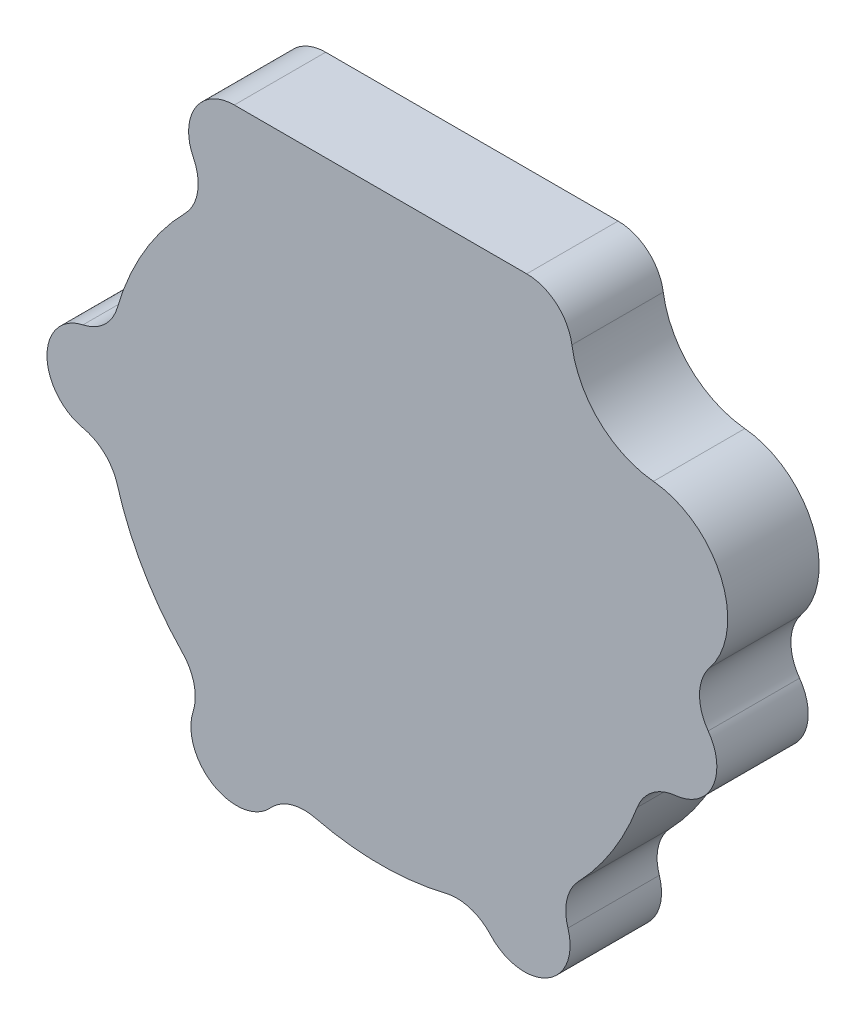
ISO-10303-21;
HEADER;
FILE_DESCRIPTION(('STEP AP214'),'2;1');
FILE_NAME('part.step','',(''),(''),'','','');
FILE_SCHEMA(('AUTOMOTIVE_DESIGN { 1 0 10303 214 1 1 1 1 }'));
ENDSEC;
DATA;
#1=APPLICATION_CONTEXT('core data for automotive mechanical design processes');
#2=APPLICATION_PROTOCOL_DEFINITION('international standard','automotive_design',2000,#1);
#3=PRODUCT_CONTEXT('',#1,'mechanical');
#4=PRODUCT('Part','Part','',(#3));
#5=PRODUCT_RELATED_PRODUCT_CATEGORY('part','',(#4));
#6=PRODUCT_DEFINITION_FORMATION('','',#4);
#7=PRODUCT_DEFINITION_CONTEXT('part definition',#1,'design');
#8=PRODUCT_DEFINITION('design','',#6,#7);
#9=PRODUCT_DEFINITION_SHAPE('','',#8);
#10=(LENGTH_UNIT() NAMED_UNIT(*) SI_UNIT(.MILLI.,.METRE.));
#11=(NAMED_UNIT(*) PLANE_ANGLE_UNIT() SI_UNIT($,.RADIAN.));
#12=(NAMED_UNIT(*) SI_UNIT($,.STERADIAN.) SOLID_ANGLE_UNIT());
#13=UNCERTAINTY_MEASURE_WITH_UNIT(LENGTH_MEASURE(1.E-05),#10,'distance_accuracy_value','');
#14=(GEOMETRIC_REPRESENTATION_CONTEXT(3) GLOBAL_UNCERTAINTY_ASSIGNED_CONTEXT((#13)) GLOBAL_UNIT_ASSIGNED_CONTEXT((#10,
#11,#12)) REPRESENTATION_CONTEXT('',''));
#15=CARTESIAN_POINT('',(0.,0.,0.));
#16=DIRECTION('',(0.,0.,1.));
#17=DIRECTION('',(1.,0.,0.));
#18=AXIS2_PLACEMENT_3D('',#15,#16,#17);
#19=CARTESIAN_POINT('',(-28.4340748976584,-24.2245230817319,10.));
#20=DIRECTION('',(0.,0.,-1.));
#21=DIRECTION('',(-1.,0.,0.));
#22=AXIS2_PLACEMENT_3D('',#19,#20,#21);
#23=CYLINDRICAL_SURFACE('',#22,5.);
#24=CARTESIAN_POINT('',(-28.4340748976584,-24.2245230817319,0.));
#25=DIRECTION('',(0.,0.,-1.));
#26=DIRECTION('',(1.,0.,0.));
#27=AXIS2_PLACEMENT_3D('',#24,#25,#26);
#28=CIRCLE('',#27,5.);
#29=CARTESIAN_POINT('',(-23.6330544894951,-25.6210197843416,0.));
#30=VERTEX_POINT('',#29);
#31=CARTESIAN_POINT('',(-27.380503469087,-29.112261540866,0.));
#32=VERTEX_POINT('',#31);
#33=EDGE_CURVE('E213',#30,#32,#28,.T.);
#34=ORIENTED_EDGE('',*,*,#33,.T.);
#35=DIRECTION('',(0.,0.,-1.));
#36=VECTOR('',#35,1.);
#37=CARTESIAN_POINT('',(-27.380503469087,-29.112261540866,10.));
#38=LINE('',#37,#36);
#39=CARTESIAN_POINT('',(-27.380503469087,-29.112261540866,10.));
#40=VERTEX_POINT('',#39);
#41=EDGE_CURVE('E11',#40,#32,#38,.T.);
#42=ORIENTED_EDGE('',*,*,#41,.F.);
#43=CARTESIAN_POINT('',(-28.4340748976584,-24.2245230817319,10.));
#44=DIRECTION('',(0.,0.,-1.));
#45=DIRECTION('',(1.,0.,0.));
#46=AXIS2_PLACEMENT_3D('',#43,#44,#45);
#47=CIRCLE('',#46,5.);
#48=CARTESIAN_POINT('',(-23.6330544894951,-25.6210197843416,10.));
#49=VERTEX_POINT('',#48);
#50=EDGE_CURVE('E256',#49,#40,#47,.T.);
#51=ORIENTED_EDGE('',*,*,#50,.F.);
#52=DIRECTION('',(0.,0.,-1.));
#53=VECTOR('',#52,1.);
#54=CARTESIAN_POINT('',(-23.6330544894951,-25.6210197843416,10.));
#55=LINE('',#54,#53);
#56=EDGE_CURVE('E209',#49,#30,#55,.T.);
#57=ORIENTED_EDGE('',*,*,#56,.T.);
#58=EDGE_LOOP('',(#34,#42,#51,#57));
#59=FACE_BOUND('',#58,.T.);
#60=ADVANCED_FACE('F33',(#59),#23,.F.);
#61=CARTESIAN_POINT('',(-26.3269320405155,-34.,10.));
#62=DIRECTION('',(0.,0.,-1.));
#63=DIRECTION('',(-1.,0.,0.));
#64=AXIS2_PLACEMENT_3D('',#61,#62,#63);
#65=CYLINDRICAL_SURFACE('',#64,5.);
#66=CARTESIAN_POINT('',(-26.3269320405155,-34.,0.));
#67=DIRECTION('',(0.,0.,1.));
#68=DIRECTION('',(1.,0.,0.));
#69=AXIS2_PLACEMENT_3D('',#66,#67,#68);
#70=CIRCLE('',#69,5.);
#71=CARTESIAN_POINT('',(-27.380503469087,-38.887738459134,0.));
#72=VERTEX_POINT('',#71);
#73=EDGE_CURVE('E216',#32,#72,#70,.T.);
#74=ORIENTED_EDGE('',*,*,#73,.T.);
#75=DIRECTION('',(0.,0.,-1.));
#76=VECTOR('',#75,1.);
#77=CARTESIAN_POINT('',(-27.380503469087,-38.887738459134,10.));
#78=LINE('',#77,#76);
#79=CARTESIAN_POINT('',(-27.380503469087,-38.887738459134,10.));
#80=VERTEX_POINT('',#79);
#81=EDGE_CURVE('E41',#80,#72,#78,.T.);
#82=ORIENTED_EDGE('',*,*,#81,.F.);
#83=CARTESIAN_POINT('',(-26.3269320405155,-34.,10.));
#84=DIRECTION('',(0.,0.,1.));
#85=DIRECTION('',(1.,0.,0.));
#86=AXIS2_PLACEMENT_3D('',#83,#84,#85);
#87=CIRCLE('',#86,5.);
#88=EDGE_CURVE('E134',#40,#80,#87,.T.);
#89=ORIENTED_EDGE('',*,*,#88,.F.);
#90=ORIENTED_EDGE('',*,*,#41,.T.);
#91=EDGE_LOOP('',(#74,#82,#89,#90));
#92=FACE_BOUND('',#91,.T.);
#93=ADVANCED_FACE('F383',(#92),#65,.T.);
#94=CARTESIAN_POINT('',(-28.4340748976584,-43.7754769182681,10.));
#95=DIRECTION('',(0.,0.,-1.));
#96=DIRECTION('',(-1.,0.,0.));
#97=AXIS2_PLACEMENT_3D('',#94,#95,#96);
#98=CYLINDRICAL_SURFACE('',#97,5.);
#99=CARTESIAN_POINT('',(-28.4340748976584,-43.7754769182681,0.));
#100=DIRECTION('',(0.,0.,-1.));
#101=DIRECTION('',(-1.,0.,0.));
#102=AXIS2_PLACEMENT_3D('',#99,#100,#101);
#103=CIRCLE('',#102,5.);
#104=CARTESIAN_POINT('',(-23.6330544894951,-42.3789802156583,0.));
#105=VERTEX_POINT('',#104);
#106=EDGE_CURVE('E218',#72,#105,#103,.T.);
#107=ORIENTED_EDGE('',*,*,#106,.T.);
#108=DIRECTION('',(0.,0.,-1.));
#109=VECTOR('',#108,1.);
#110=CARTESIAN_POINT('',(-23.6330544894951,-42.3789802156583,10.));
#111=LINE('',#110,#109);
#112=CARTESIAN_POINT('',(-23.6330544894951,-42.3789802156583,10.));
#113=VERTEX_POINT('',#112);
#114=EDGE_CURVE('E305',#113,#105,#111,.T.);
#115=ORIENTED_EDGE('',*,*,#114,.F.);
#116=CARTESIAN_POINT('',(-28.4340748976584,-43.7754769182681,10.));
#117=DIRECTION('',(0.,0.,-1.));
#118=DIRECTION('',(-1.,0.,0.));
#119=AXIS2_PLACEMENT_3D('',#116,#117,#118);
#120=CIRCLE('',#119,5.);
#121=EDGE_CURVE('E313',#80,#113,#120,.T.);
#122=ORIENTED_EDGE('',*,*,#121,.F.);
#123=ORIENTED_EDGE('',*,*,#81,.T.);
#124=EDGE_LOOP('',(#107,#115,#122,#123));
#125=FACE_BOUND('',#124,.T.);
#126=ADVANCED_FACE('F311',(#125),#98,.F.);
#127=CARTESIAN_POINT('',(5.17306795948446,-34.,10.));
#128=DIRECTION('',(0.,0.,-1.));
#129=DIRECTION('',(-1.,0.,0.));
#130=AXIS2_PLACEMENT_3D('',#127,#128,#129);
#131=CYLINDRICAL_SURFACE('',#130,30.);
#132=CARTESIAN_POINT('',(5.17306795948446,-34.,0.));
#133=DIRECTION('',(0.,0.,1.));
#134=DIRECTION('',(1.,0.,0.));
#135=AXIS2_PLACEMENT_3D('',#132,#133,#134);
#136=CIRCLE('',#135,30.);
#137=CARTESIAN_POINT('',(-16.4864029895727,-54.7573437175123,0.));
#138=VERTEX_POINT('',#137);
#139=EDGE_CURVE('E220',#105,#138,#136,.T.);
#140=ORIENTED_EDGE('',*,*,#139,.T.);
#141=DIRECTION('',(0.,0.,-1.));
#142=VECTOR('',#141,1.);
#143=CARTESIAN_POINT('',(-16.4864029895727,-54.7573437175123,10.));
#144=LINE('',#143,#142);
#145=CARTESIAN_POINT('',(-16.4864029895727,-54.7573437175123,10.));
#146=VERTEX_POINT('',#145);
#147=EDGE_CURVE('E302',#146,#138,#144,.T.);
#148=ORIENTED_EDGE('',*,*,#147,.F.);
#149=CARTESIAN_POINT('',(5.17306795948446,-34.,10.));
#150=DIRECTION('',(0.,0.,1.));
#151=DIRECTION('',(1.,0.,0.));
#152=AXIS2_PLACEMENT_3D('',#149,#150,#151);
#153=CIRCLE('',#152,30.);
#154=EDGE_CURVE('E331',#113,#146,#153,.T.);
#155=ORIENTED_EDGE('',*,*,#154,.F.);
#156=ORIENTED_EDGE('',*,*,#114,.T.);
#157=EDGE_LOOP('',(#140,#148,#155,#156));
#158=FACE_BOUND('',#157,.T.);
#159=ADVANCED_FACE('F322',(#158),#131,.T.);
#160=CARTESIAN_POINT('',(-20.0963148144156,-58.2169010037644,10.));
#161=DIRECTION('',(0.,0.,-1.));
#162=DIRECTION('',(-1.,0.,0.));
#163=AXIS2_PLACEMENT_3D('',#160,#161,#162);
#164=CYLINDRICAL_SURFACE('',#163,5.);
#165=CARTESIAN_POINT('',(-20.0963148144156,-58.2169010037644,0.));
#166=DIRECTION('',(0.,0.,-1.));
#167=DIRECTION('',(1.,0.,0.));
#168=AXIS2_PLACEMENT_3D('',#165,#166,#167);
#169=CIRCLE('',#168,5.);
#170=CARTESIAN_POINT('',(-15.3366234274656,-59.7483506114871,0.));
#171=VERTEX_POINT('',#170);
#172=EDGE_CURVE('E222',#138,#171,#169,.T.);
#173=ORIENTED_EDGE('',*,*,#172,.T.);
#174=DIRECTION('',(0.,0.,-1.));
#175=VECTOR('',#174,1.);
#176=CARTESIAN_POINT('',(-15.3366234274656,-59.7483506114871,10.));
#177=LINE('',#176,#175);
#178=CARTESIAN_POINT('',(-15.3366234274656,-59.7483506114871,10.));
#179=VERTEX_POINT('',#178);
#180=EDGE_CURVE('E299',#179,#171,#177,.T.);
#181=ORIENTED_EDGE('',*,*,#180,.F.);
#182=CARTESIAN_POINT('',(-20.0963148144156,-58.2169010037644,10.));
#183=DIRECTION('',(0.,0.,-1.));
#184=DIRECTION('',(1.,0.,0.));
#185=AXIS2_PLACEMENT_3D('',#182,#183,#184);
#186=CIRCLE('',#185,5.);
#187=EDGE_CURVE('E328',#146,#179,#186,.T.);
#188=ORIENTED_EDGE('',*,*,#187,.F.);
#189=ORIENTED_EDGE('',*,*,#147,.T.);
#190=EDGE_LOOP('',(#173,#181,#188,#189));
#191=FACE_BOUND('',#190,.T.);
#192=ADVANCED_FACE('F326',(#191),#164,.F.);
#193=CARTESIAN_POINT('',(-10.5769320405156,-61.2798002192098,10.));
#194=DIRECTION('',(0.,0.,-1.));
#195=DIRECTION('',(-1.,0.,0.));
#196=AXIS2_PLACEMENT_3D('',#193,#194,#195);
#197=CYLINDRICAL_SURFACE('',#196,5.);
#198=CARTESIAN_POINT('',(-10.5769320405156,-61.2798002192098,0.));
#199=DIRECTION('',(0.,0.,1.));
#200=DIRECTION('',(1.,0.,0.));
#201=AXIS2_PLACEMENT_3D('',#198,#199,#200);
#202=CIRCLE('',#201,5.);
#203=CARTESIAN_POINT('',(-6.870812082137,-64.6360890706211,0.));
#204=VERTEX_POINT('',#203);
#205=EDGE_CURVE('E224',#171,#204,#202,.T.);
#206=ORIENTED_EDGE('',*,*,#205,.T.);
#207=DIRECTION('',(0.,0.,-1.));
#208=VECTOR('',#207,1.);
#209=CARTESIAN_POINT('',(-6.870812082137,-64.6360890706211,10.));
#210=LINE('',#209,#208);
#211=CARTESIAN_POINT('',(-6.870812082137,-64.6360890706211,10.));
#212=VERTEX_POINT('',#211);
#213=EDGE_CURVE('E296',#212,#204,#210,.T.);
#214=ORIENTED_EDGE('',*,*,#213,.F.);
#215=CARTESIAN_POINT('',(-10.5769320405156,-61.2798002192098,10.));
#216=DIRECTION('',(0.,0.,1.));
#217=DIRECTION('',(1.,0.,0.));
#218=AXIS2_PLACEMENT_3D('',#215,#216,#217);
#219=CIRCLE('',#218,5.);
#220=EDGE_CURVE('E330',#179,#212,#219,.T.);
#221=ORIENTED_EDGE('',*,*,#220,.F.);
#222=ORIENTED_EDGE('',*,*,#180,.T.);
#223=EDGE_LOOP('',(#206,#214,#221,#222));
#224=FACE_BOUND('',#223,.T.);
#225=ADVANCED_FACE('F396',(#224),#197,.T.);
#226=CARTESIAN_POINT('',(-3.16469212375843,-67.9923779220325,10.));
#227=DIRECTION('',(0.,0.,-1.));
#228=DIRECTION('',(-1.,0.,0.));
#229=AXIS2_PLACEMENT_3D('',#226,#227,#228);
#230=CYLINDRICAL_SURFACE('',#229,4.99999999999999);
#231=CARTESIAN_POINT('',(-3.16469212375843,-67.9923779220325,0.));
#232=DIRECTION('',(0.,0.,-1.));
#233=DIRECTION('',(-1.,0.,0.));
#234=AXIS2_PLACEMENT_3D('',#231,#232,#233);
#235=CIRCLE('',#234,4.99999999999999);
#236=CARTESIAN_POINT('',(-1.97358354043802,-63.1363239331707,0.));
#237=VERTEX_POINT('',#236);
#238=EDGE_CURVE('E226',#204,#237,#235,.T.);
#239=ORIENTED_EDGE('',*,*,#238,.T.);
#240=DIRECTION('',(0.,0.,-1.));
#241=VECTOR('',#240,1.);
#242=CARTESIAN_POINT('',(-1.97358354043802,-63.1363239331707,10.));
#243=LINE('',#242,#241);
#244=CARTESIAN_POINT('',(-1.97358354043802,-63.1363239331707,10.));
#245=VERTEX_POINT('',#244);
#246=EDGE_CURVE('E293',#245,#237,#243,.T.);
#247=ORIENTED_EDGE('',*,*,#246,.F.);
#248=CARTESIAN_POINT('',(-3.16469212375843,-67.9923779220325,10.));
#249=DIRECTION('',(0.,0.,-1.));
#250=DIRECTION('',(-1.,0.,0.));
#251=AXIS2_PLACEMENT_3D('',#248,#249,#250);
#252=CIRCLE('',#251,4.99999999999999);
#253=EDGE_CURVE('E333',#212,#245,#252,.T.);
#254=ORIENTED_EDGE('',*,*,#253,.F.);
#255=ORIENTED_EDGE('',*,*,#213,.T.);
#256=EDGE_LOOP('',(#239,#247,#254,#255));
#257=FACE_BOUND('',#256,.T.);
#258=ADVANCED_FACE('F399',(#257),#230,.F.);
#259=CARTESIAN_POINT('',(5.17306795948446,-34.,10.));
#260=DIRECTION('',(0.,0.,-1.));
#261=DIRECTION('',(-1.,0.,0.));
#262=AXIS2_PLACEMENT_3D('',#259,#260,#261);
#263=CYLINDRICAL_SURFACE('',#262,30.);
#264=CARTESIAN_POINT('',(5.17306795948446,-34.,0.));
#265=DIRECTION('',(0.,0.,1.));
#266=DIRECTION('',(1.,0.,0.));
#267=AXIS2_PLACEMENT_3D('',#264,#265,#266);
#268=CIRCLE('',#267,30.);
#269=CARTESIAN_POINT('',(12.3197194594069,-63.1363239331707,0.));
#270=VERTEX_POINT('',#269);
#271=EDGE_CURVE('E228',#237,#270,#268,.T.);
#272=ORIENTED_EDGE('',*,*,#271,.T.);
#273=DIRECTION('',(0.,0.,-1.));
#274=VECTOR('',#273,1.);
#275=CARTESIAN_POINT('',(12.3197194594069,-63.1363239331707,10.));
#276=LINE('',#275,#274);
#277=CARTESIAN_POINT('',(12.3197194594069,-63.1363239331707,10.));
#278=VERTEX_POINT('',#277);
#279=EDGE_CURVE('E290',#278,#270,#276,.T.);
#280=ORIENTED_EDGE('',*,*,#279,.F.);
#281=CARTESIAN_POINT('',(5.17306795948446,-34.,10.));
#282=DIRECTION('',(0.,0.,1.));
#283=DIRECTION('',(1.,0.,0.));
#284=AXIS2_PLACEMENT_3D('',#281,#282,#283);
#285=CIRCLE('',#284,30.);
#286=EDGE_CURVE('E339',#245,#278,#285,.T.);
#287=ORIENTED_EDGE('',*,*,#286,.F.);
#288=ORIENTED_EDGE('',*,*,#246,.T.);
#289=EDGE_LOOP('',(#272,#280,#287,#288));
#290=FACE_BOUND('',#289,.T.);
#291=ADVANCED_FACE('F403',(#290),#263,.T.);
#292=CARTESIAN_POINT('',(13.5108280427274,-67.9923779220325,10.));
#293=DIRECTION('',(0.,0.,-1.));
#294=DIRECTION('',(-1.,0.,0.));
#295=AXIS2_PLACEMENT_3D('',#292,#293,#294);
#296=CYLINDRICAL_SURFACE('',#295,4.99999999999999);
#297=CARTESIAN_POINT('',(13.5108280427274,-67.9923779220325,0.));
#298=DIRECTION('',(0.,0.,-1.));
#299=DIRECTION('',(1.,0.,0.));
#300=AXIS2_PLACEMENT_3D('',#297,#298,#299);
#301=CIRCLE('',#300,4.99999999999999);
#302=CARTESIAN_POINT('',(17.2169480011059,-64.6360890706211,0.));
#303=VERTEX_POINT('',#302);
#304=EDGE_CURVE('E230',#270,#303,#301,.T.);
#305=ORIENTED_EDGE('',*,*,#304,.T.);
#306=DIRECTION('',(0.,0.,-1.));
#307=VECTOR('',#306,1.);
#308=CARTESIAN_POINT('',(17.2169480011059,-64.6360890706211,10.));
#309=LINE('',#308,#307);
#310=CARTESIAN_POINT('',(17.2169480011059,-64.6360890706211,10.));
#311=VERTEX_POINT('',#310);
#312=EDGE_CURVE('E287',#311,#303,#309,.T.);
#313=ORIENTED_EDGE('',*,*,#312,.F.);
#314=CARTESIAN_POINT('',(13.5108280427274,-67.9923779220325,10.));
#315=DIRECTION('',(0.,0.,-1.));
#316=DIRECTION('',(1.,0.,0.));
#317=AXIS2_PLACEMENT_3D('',#314,#315,#316);
#318=CIRCLE('',#317,4.99999999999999);
#319=EDGE_CURVE('E341',#278,#311,#318,.T.);
#320=ORIENTED_EDGE('',*,*,#319,.F.);
#321=ORIENTED_EDGE('',*,*,#279,.T.);
#322=EDGE_LOOP('',(#305,#313,#320,#321));
#323=FACE_BOUND('',#322,.T.);
#324=ADVANCED_FACE('F407',(#323),#296,.F.);
#325=CARTESIAN_POINT('',(20.9230679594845,-61.2798002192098,10.));
#326=DIRECTION('',(0.,0.,-1.));
#327=DIRECTION('',(-1.,0.,0.));
#328=AXIS2_PLACEMENT_3D('',#325,#326,#327);
#329=CYLINDRICAL_SURFACE('',#328,5.);
#330=CARTESIAN_POINT('',(20.9230679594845,-61.2798002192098,0.));
#331=DIRECTION('',(0.,0.,1.));
#332=DIRECTION('',(1.,0.,0.));
#333=AXIS2_PLACEMENT_3D('',#330,#331,#332);
#334=CIRCLE('',#333,5.);
#335=CARTESIAN_POINT('',(25.6827593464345,-59.7483506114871,0.));
#336=VERTEX_POINT('',#335);
#337=EDGE_CURVE('E232',#303,#336,#334,.T.);
#338=ORIENTED_EDGE('',*,*,#337,.T.);
#339=DIRECTION('',(0.,0.,-1.));
#340=VECTOR('',#339,1.);
#341=CARTESIAN_POINT('',(25.6827593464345,-59.7483506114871,10.));
#342=LINE('',#341,#340);
#343=CARTESIAN_POINT('',(25.6827593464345,-59.7483506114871,10.));
#344=VERTEX_POINT('',#343);
#345=EDGE_CURVE('E284',#344,#336,#342,.T.);
#346=ORIENTED_EDGE('',*,*,#345,.F.);
#347=CARTESIAN_POINT('',(20.9230679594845,-61.2798002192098,10.));
#348=DIRECTION('',(0.,0.,1.));
#349=DIRECTION('',(1.,0.,0.));
#350=AXIS2_PLACEMENT_3D('',#347,#348,#349);
#351=CIRCLE('',#350,5.);
#352=EDGE_CURVE('E343',#311,#344,#351,.T.);
#353=ORIENTED_EDGE('',*,*,#352,.F.);
#354=ORIENTED_EDGE('',*,*,#312,.T.);
#355=EDGE_LOOP('',(#338,#346,#353,#354));
#356=FACE_BOUND('',#355,.T.);
#357=ADVANCED_FACE('F411',(#356),#329,.T.);
#358=CARTESIAN_POINT('',(30.4424507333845,-58.2169010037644,10.));
#359=DIRECTION('',(0.,0.,-1.));
#360=DIRECTION('',(-1.,0.,0.));
#361=AXIS2_PLACEMENT_3D('',#358,#359,#360);
#362=CYLINDRICAL_SURFACE('',#361,4.99999999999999);
#363=CARTESIAN_POINT('',(30.4424507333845,-58.2169010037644,0.));
#364=DIRECTION('',(0.,0.,-1.));
#365=DIRECTION('',(-1.,0.,0.));
#366=AXIS2_PLACEMENT_3D('',#363,#364,#365);
#367=CIRCLE('',#366,4.99999999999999);
#368=CARTESIAN_POINT('',(26.8325389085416,-54.7573437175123,0.));
#369=VERTEX_POINT('',#368);
#370=EDGE_CURVE('E234',#336,#369,#367,.T.);
#371=ORIENTED_EDGE('',*,*,#370,.T.);
#372=DIRECTION('',(0.,0.,-1.));
#373=VECTOR('',#372,1.);
#374=CARTESIAN_POINT('',(26.8325389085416,-54.7573437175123,10.));
#375=LINE('',#374,#373);
#376=CARTESIAN_POINT('',(26.8325389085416,-54.7573437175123,10.));
#377=VERTEX_POINT('',#376);
#378=EDGE_CURVE('E281',#377,#369,#375,.T.);
#379=ORIENTED_EDGE('',*,*,#378,.F.);
#380=CARTESIAN_POINT('',(30.4424507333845,-58.2169010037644,10.));
#381=DIRECTION('',(0.,0.,-1.));
#382=DIRECTION('',(-1.,0.,0.));
#383=AXIS2_PLACEMENT_3D('',#380,#381,#382);
#384=CIRCLE('',#383,4.99999999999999);
#385=EDGE_CURVE('E345',#344,#377,#384,.T.);
#386=ORIENTED_EDGE('',*,*,#385,.F.);
#387=ORIENTED_EDGE('',*,*,#345,.T.);
#388=EDGE_LOOP('',(#371,#379,#386,#387));
#389=FACE_BOUND('',#388,.T.);
#390=ADVANCED_FACE('F415',(#389),#362,.F.);
#391=CARTESIAN_POINT('',(5.17306795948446,-34.,10.));
#392=DIRECTION('',(0.,0.,-1.));
#393=DIRECTION('',(-1.,0.,0.));
#394=AXIS2_PLACEMENT_3D('',#391,#392,#393);
#395=CYLINDRICAL_SURFACE('',#394,30.);
#396=CARTESIAN_POINT('',(5.17306795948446,-34.,0.));
#397=DIRECTION('',(0.,0.,1.));
#398=DIRECTION('',(1.,0.,0.));
#399=AXIS2_PLACEMENT_3D('',#396,#397,#398);
#400=CIRCLE('',#399,30.);
#401=CARTESIAN_POINT('',(33.2684011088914,-44.5191375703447,0.));
#402=VERTEX_POINT('',#401);
#403=EDGE_CURVE('E236',#369,#402,#400,.T.);
#404=ORIENTED_EDGE('',*,*,#403,.T.);
#405=DIRECTION('',(0.,0.,-1.));
#406=VECTOR('',#405,1.);
#407=CARTESIAN_POINT('',(33.2684011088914,-44.5191375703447,10.));
#408=LINE('',#407,#406);
#409=CARTESIAN_POINT('',(33.2684011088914,-44.5191375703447,10.));
#410=VERTEX_POINT('',#409);
#411=EDGE_CURVE('E278',#410,#402,#408,.T.);
#412=ORIENTED_EDGE('',*,*,#411,.F.);
#413=CARTESIAN_POINT('',(5.17306795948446,-34.,10.));
#414=DIRECTION('',(0.,0.,1.));
#415=DIRECTION('',(1.,0.,0.));
#416=AXIS2_PLACEMENT_3D('',#413,#414,#415);
#417=CIRCLE('',#416,30.);
#418=EDGE_CURVE('E347',#377,#410,#417,.T.);
#419=ORIENTED_EDGE('',*,*,#418,.F.);
#420=ORIENTED_EDGE('',*,*,#378,.T.);
#421=EDGE_LOOP('',(#404,#412,#419,#420));
#422=FACE_BOUND('',#421,.T.);
#423=ADVANCED_FACE('F419',(#422),#395,.T.);
#424=CARTESIAN_POINT('',(37.9509566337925,-46.2723271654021,10.));
#425=DIRECTION('',(0.,0.,-1.));
#426=DIRECTION('',(-1.,0.,0.));
#427=AXIS2_PLACEMENT_3D('',#424,#425,#426);
#428=CYLINDRICAL_SURFACE('',#427,5.);
#429=CARTESIAN_POINT('',(37.9509566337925,-46.2723271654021,0.));
#430=DIRECTION('',(0.,0.,-1.));
#431=DIRECTION('',(1.,0.,0.));
#432=AXIS2_PLACEMENT_3D('',#429,#430,#431);
#433=CIRCLE('',#432,5.);
#434=CARTESIAN_POINT('',(37.4651628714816,-41.2959826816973,0.));
#435=VERTEX_POINT('',#434);
#436=EDGE_CURVE('E238',#402,#435,#433,.T.);
#437=ORIENTED_EDGE('',*,*,#436,.T.);
#438=DIRECTION('',(0.,0.,-1.));
#439=VECTOR('',#438,1.);
#440=CARTESIAN_POINT('',(37.4651628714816,-41.2959826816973,10.));
#441=LINE('',#440,#439);
#442=CARTESIAN_POINT('',(37.4651628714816,-41.2959826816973,10.));
#443=VERTEX_POINT('',#442);
#444=EDGE_CURVE('E275',#443,#435,#441,.T.);
#445=ORIENTED_EDGE('',*,*,#444,.F.);
#446=CARTESIAN_POINT('',(37.9509566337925,-46.2723271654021,10.));
#447=DIRECTION('',(0.,0.,-1.));
#448=DIRECTION('',(1.,0.,0.));
#449=AXIS2_PLACEMENT_3D('',#446,#447,#448);
#450=CIRCLE('',#449,5.);
#451=EDGE_CURVE('E349',#410,#443,#450,.T.);
#452=ORIENTED_EDGE('',*,*,#451,.F.);
#453=ORIENTED_EDGE('',*,*,#411,.T.);
#454=EDGE_LOOP('',(#437,#445,#452,#453));
#455=FACE_BOUND('',#454,.T.);
#456=ADVANCED_FACE('F423',(#455),#428,.F.);
#457=CARTESIAN_POINT('',(36.9793691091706,-36.3196381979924,10.));
#458=DIRECTION('',(0.,0.,-1.));
#459=DIRECTION('',(-1.,0.,0.));
#460=AXIS2_PLACEMENT_3D('',#457,#458,#459);
#461=CYLINDRICAL_SURFACE('',#460,5.);
#462=CARTESIAN_POINT('',(36.9793691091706,-36.3196381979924,0.));
#463=DIRECTION('',(0.,0.,1.));
#464=DIRECTION('',(-1.,0.,0.));
#465=AXIS2_PLACEMENT_3D('',#462,#463,#464);
#466=CIRCLE('',#465,5.);
#467=CARTESIAN_POINT('',(41.0311773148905,-33.3899880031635,0.));
#468=VERTEX_POINT('',#467);
#469=EDGE_CURVE('E240',#435,#468,#466,.T.);
#470=ORIENTED_EDGE('',*,*,#469,.T.);
#471=DIRECTION('',(0.,0.,-1.));
#472=VECTOR('',#471,1.);
#473=CARTESIAN_POINT('',(41.0311773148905,-33.3899880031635,10.));
#474=LINE('',#473,#472);
#475=CARTESIAN_POINT('',(41.0311773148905,-33.3899880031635,10.));
#476=VERTEX_POINT('',#475);
#477=EDGE_CURVE('E272',#476,#468,#474,.T.);
#478=ORIENTED_EDGE('',*,*,#477,.F.);
#479=CARTESIAN_POINT('',(36.9793691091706,-36.3196381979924,10.));
#480=DIRECTION('',(0.,0.,1.));
#481=DIRECTION('',(-1.,0.,0.));
#482=AXIS2_PLACEMENT_3D('',#479,#480,#481);
#483=CIRCLE('',#482,5.);
#484=EDGE_CURVE('E351',#443,#476,#483,.T.);
#485=ORIENTED_EDGE('',*,*,#484,.F.);
#486=ORIENTED_EDGE('',*,*,#444,.T.);
#487=EDGE_LOOP('',(#470,#478,#485,#486));
#488=FACE_BOUND('',#487,.T.);
#489=ADVANCED_FACE('F427',(#488),#461,.T.);
#490=CARTESIAN_POINT('',(45.0829855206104,-30.4603378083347,10.));
#491=DIRECTION('',(0.,0.,-1.));
#492=DIRECTION('',(-1.,0.,0.));
#493=AXIS2_PLACEMENT_3D('',#490,#491,#492);
#494=CYLINDRICAL_SURFACE('',#493,5.);
#495=CARTESIAN_POINT('',(45.0829855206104,-30.4603378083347,0.));
#496=DIRECTION('',(0.,0.,-1.));
#497=DIRECTION('',(1.,0.,0.));
#498=AXIS2_PLACEMENT_3D('',#495,#496,#497);
#499=CIRCLE('',#498,5.);
#500=CARTESIAN_POINT('',(41.185123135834,-27.3287776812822,0.));
#501=VERTEX_POINT('',#500);
#502=EDGE_CURVE('E242',#468,#501,#499,.T.);
#503=ORIENTED_EDGE('',*,*,#502,.T.);
#504=DIRECTION('',(0.,0.,-1.));
#505=VECTOR('',#504,1.);
#506=CARTESIAN_POINT('',(41.185123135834,-27.3287776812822,10.));
#507=LINE('',#506,#505);
#508=CARTESIAN_POINT('',(41.185123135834,-27.3287776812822,10.));
#509=VERTEX_POINT('',#508);
#510=EDGE_CURVE('E269',#509,#501,#507,.T.);
#511=ORIENTED_EDGE('',*,*,#510,.F.);
#512=CARTESIAN_POINT('',(45.0829855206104,-30.4603378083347,10.));
#513=DIRECTION('',(0.,0.,-1.));
#514=DIRECTION('',(1.,0.,0.));
#515=AXIS2_PLACEMENT_3D('',#512,#513,#514);
#516=CIRCLE('',#515,5.);
#517=EDGE_CURVE('E353',#476,#509,#516,.T.);
#518=ORIENTED_EDGE('',*,*,#517,.F.);
#519=ORIENTED_EDGE('',*,*,#477,.T.);
#520=EDGE_LOOP('',(#503,#511,#518,#519));
#521=FACE_BOUND('',#520,.T.);
#522=ADVANCED_FACE('F431',(#521),#494,.F.);
#523=CARTESIAN_POINT('',(34.1689708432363,-21.6919694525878,10.));
#524=DIRECTION('',(0.,0.,-1.));
#525=DIRECTION('',(-1.,0.,0.));
#526=AXIS2_PLACEMENT_3D('',#523,#524,#525);
#527=CYLINDRICAL_SURFACE('',#526,9.);
#528=CARTESIAN_POINT('',(34.1689708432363,-21.6919694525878,0.));
#529=DIRECTION('',(0.,0.,1.));
#530=DIRECTION('',(-1.,0.,0.));
#531=AXIS2_PLACEMENT_3D('',#528,#529,#530);
#532=CIRCLE('',#531,9.);
#533=CARTESIAN_POINT('',(35.0401162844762,-12.7342294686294,0.));
#534=VERTEX_POINT('',#533);
#535=EDGE_CURVE('E244',#501,#534,#532,.T.);
#536=ORIENTED_EDGE('',*,*,#535,.T.);
#537=DIRECTION('',(0.,0.,-1.));
#538=VECTOR('',#537,1.);
#539=CARTESIAN_POINT('',(35.0401162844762,-12.7342294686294,10.));
#540=LINE('',#539,#538);
#541=CARTESIAN_POINT('',(35.0401162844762,-12.7342294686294,10.));
#542=VERTEX_POINT('',#541);
#543=EDGE_CURVE('E266',#542,#534,#540,.T.);
#544=ORIENTED_EDGE('',*,*,#543,.F.);
#545=CARTESIAN_POINT('',(34.1689708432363,-21.6919694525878,10.));
#546=DIRECTION('',(0.,0.,1.));
#547=DIRECTION('',(-1.,0.,0.));
#548=AXIS2_PLACEMENT_3D('',#545,#546,#547);
#549=CIRCLE('',#548,9.);
#550=EDGE_CURVE('E355',#509,#542,#549,.T.);
#551=ORIENTED_EDGE('',*,*,#550,.F.);
#552=ORIENTED_EDGE('',*,*,#510,.T.);
#553=EDGE_LOOP('',(#536,#544,#551,#552));
#554=FACE_BOUND('',#553,.T.);
#555=ADVANCED_FACE('F435',(#554),#527,.T.);
#556=CARTESIAN_POINT('',(36.0080556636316,-2.781185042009,10.));
#557=DIRECTION('',(0.,0.,-1.));
#558=DIRECTION('',(-1.,0.,0.));
#559=AXIS2_PLACEMENT_3D('',#556,#557,#558);
#560=CYLINDRICAL_SURFACE('',#559,10.);
#561=CARTESIAN_POINT('',(36.0080556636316,-2.781185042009,0.));
#562=DIRECTION('',(0.,0.,-1.));
#563=DIRECTION('',(1.,0.,0.));
#564=AXIS2_PLACEMENT_3D('',#561,#562,#563);
#565=CIRCLE('',#564,10.);
#566=CARTESIAN_POINT('',(26.1180638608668,-4.260395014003,0.));
#567=VERTEX_POINT('',#566);
#568=EDGE_CURVE('E246',#534,#567,#565,.T.);
#569=ORIENTED_EDGE('',*,*,#568,.T.);
#570=DIRECTION('',(0.,0.,-1.));
#571=VECTOR('',#570,1.);
#572=CARTESIAN_POINT('',(26.1180638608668,-4.260395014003,10.));
#573=LINE('',#572,#571);
#574=CARTESIAN_POINT('',(26.1180638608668,-4.260395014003,10.));
#575=VERTEX_POINT('',#574);
#576=EDGE_CURVE('E263',#575,#567,#573,.T.);
#577=ORIENTED_EDGE('',*,*,#576,.F.);
#578=CARTESIAN_POINT('',(36.0080556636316,-2.781185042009,10.));
#579=DIRECTION('',(0.,0.,-1.));
#580=DIRECTION('',(1.,0.,0.));
#581=AXIS2_PLACEMENT_3D('',#578,#579,#580);
#582=CIRCLE('',#581,10.);
#583=EDGE_CURVE('E357',#542,#575,#582,.T.);
#584=ORIENTED_EDGE('',*,*,#583,.F.);
#585=ORIENTED_EDGE('',*,*,#543,.T.);
#586=EDGE_LOOP('',(#569,#577,#584,#585));
#587=FACE_BOUND('',#586,.T.);
#588=ADVANCED_FACE('F439',(#587),#560,.F.);
#589=CARTESIAN_POINT('',(21.1730679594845,-5.,10.));
#590=DIRECTION('',(0.,0.,-1.));
#591=DIRECTION('',(-1.,0.,0.));
#592=AXIS2_PLACEMENT_3D('',#589,#590,#591);
#593=CYLINDRICAL_SURFACE('',#592,5.);
#594=CARTESIAN_POINT('',(21.1730679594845,-5.,0.));
#595=DIRECTION('',(0.,0.,1.));
#596=DIRECTION('',(-1.,0.,0.));
#597=AXIS2_PLACEMENT_3D('',#594,#595,#596);
#598=CIRCLE('',#597,5.);
#599=CARTESIAN_POINT('',(21.1730679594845,0.,0.));
#600=VERTEX_POINT('',#599);
#601=EDGE_CURVE('E248',#567,#600,#598,.T.);
#602=ORIENTED_EDGE('',*,*,#601,.T.);
#603=DIRECTION('',(0.,0.,-1.));
#604=VECTOR('',#603,1.);
#605=CARTESIAN_POINT('',(21.1730679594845,0.,10.));
#606=LINE('',#605,#604);
#607=CARTESIAN_POINT('',(21.1730679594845,0.,10.));
#608=VERTEX_POINT('',#607);
#609=EDGE_CURVE('E260',#608,#600,#606,.T.);
#610=ORIENTED_EDGE('',*,*,#609,.F.);
#611=CARTESIAN_POINT('',(21.1730679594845,-5.,10.));
#612=DIRECTION('',(0.,0.,1.));
#613=DIRECTION('',(-1.,0.,0.));
#614=AXIS2_PLACEMENT_3D('',#611,#612,#613);
#615=CIRCLE('',#614,5.);
#616=EDGE_CURVE('E359',#575,#608,#615,.T.);
#617=ORIENTED_EDGE('',*,*,#616,.F.);
#618=ORIENTED_EDGE('',*,*,#576,.T.);
#619=EDGE_LOOP('',(#602,#610,#617,#618));
#620=FACE_BOUND('',#619,.T.);
#621=ADVANCED_FACE('F365',(#620),#593,.T.);
#622=CARTESIAN_POINT('',(5.17306795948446,0.,10.));
#623=DIRECTION('',(0.,-1.,0.));
#624=DIRECTION('',(1.,0.,0.));
#625=AXIS2_PLACEMENT_3D('',#622,#623,#624);
#626=PLANE('',#625);
#627=DIRECTION('',(-1.,0.,0.));
#628=VECTOR('',#627,1.);
#629=CARTESIAN_POINT('',(5.17306795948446,0.,0.));
#630=LINE('',#629,#628);
#631=CARTESIAN_POINT('',(-10.8269320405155,0.,0.));
#632=VERTEX_POINT('',#631);
#633=EDGE_CURVE('E251',#600,#632,#630,.T.);
#634=ORIENTED_EDGE('',*,*,#633,.T.);
#635=DIRECTION('',(0.,0.,-1.));
#636=VECTOR('',#635,1.);
#637=CARTESIAN_POINT('',(-10.8269320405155,0.,10.));
#638=LINE('',#637,#636);
#639=CARTESIAN_POINT('',(-10.8269320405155,0.,10.));
#640=VERTEX_POINT('',#639);
#641=EDGE_CURVE('E204',#640,#632,#638,.T.);
#642=ORIENTED_EDGE('',*,*,#641,.F.);
#643=DIRECTION('',(-1.,0.,0.));
#644=VECTOR('',#643,1.);
#645=CARTESIAN_POINT('',(5.17306795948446,0.,10.));
#646=LINE('',#645,#644);
#647=EDGE_CURVE('E195',#608,#640,#646,.T.);
#648=ORIENTED_EDGE('',*,*,#647,.F.);
#649=ORIENTED_EDGE('',*,*,#609,.T.);
#650=EDGE_LOOP('',(#634,#642,#648,#649));
#651=FACE_BOUND('',#650,.T.);
#652=ADVANCED_FACE('F368',(#651),#626,.F.);
#653=CARTESIAN_POINT('',(-10.8269320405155,-5.,10.));
#654=DIRECTION('',(0.,0.,-1.));
#655=DIRECTION('',(-1.,0.,0.));
#656=AXIS2_PLACEMENT_3D('',#653,#654,#655);
#657=CYLINDRICAL_SURFACE('',#656,5.);
#658=CARTESIAN_POINT('',(-10.8269320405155,-5.,0.));
#659=DIRECTION('',(0.,0.,1.));
#660=DIRECTION('',(1.,0.,0.));
#661=AXIS2_PLACEMENT_3D('',#658,#659,#660);
#662=CIRCLE('',#661,5.);
#663=CARTESIAN_POINT('',(-15.3030043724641,-7.22817783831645,0.));
#664=VERTEX_POINT('',#663);
#665=EDGE_CURVE('E203',#632,#664,#662,.T.);
#666=ORIENTED_EDGE('',*,*,#665,.T.);
#667=DIRECTION('',(0.,0.,-1.));
#668=VECTOR('',#667,1.);
#669=CARTESIAN_POINT('',(-15.3030043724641,-7.22817783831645,10.));
#670=LINE('',#669,#668);
#671=CARTESIAN_POINT('',(-15.3030043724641,-7.22817783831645,10.));
#672=VERTEX_POINT('',#671);
#673=EDGE_CURVE('E200',#672,#664,#670,.T.);
#674=ORIENTED_EDGE('',*,*,#673,.F.);
#675=CARTESIAN_POINT('',(-10.8269320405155,-5.,10.));
#676=DIRECTION('',(0.,0.,1.));
#677=DIRECTION('',(1.,0.,0.));
#678=AXIS2_PLACEMENT_3D('',#675,#676,#677);
#679=CIRCLE('',#678,5.);
#680=EDGE_CURVE('E189',#640,#672,#679,.T.);
#681=ORIENTED_EDGE('',*,*,#680,.F.);
#682=ORIENTED_EDGE('',*,*,#641,.T.);
#683=EDGE_LOOP('',(#666,#674,#681,#682));
#684=FACE_BOUND('',#683,.T.);
#685=ADVANCED_FACE('F201',(#684),#657,.T.);
#686=CARTESIAN_POINT('',(-19.7790767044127,-9.4563556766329,10.));
#687=DIRECTION('',(0.,0.,-1.));
#688=DIRECTION('',(-1.,0.,0.));
#689=AXIS2_PLACEMENT_3D('',#686,#687,#688);
#690=CYLINDRICAL_SURFACE('',#689,5.);
#691=CARTESIAN_POINT('',(-19.7790767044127,-9.4563556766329,0.));
#692=DIRECTION('',(0.,0.,-1.));
#693=DIRECTION('',(-1.,0.,0.));
#694=AXIS2_PLACEMENT_3D('',#691,#692,#693);
#695=CIRCLE('',#694,5.);
#696=CARTESIAN_POINT('',(-16.2144846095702,-12.9625905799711,0.));
#697=VERTEX_POINT('',#696);
#698=EDGE_CURVE('E120',#664,#697,#695,.T.);
#699=ORIENTED_EDGE('',*,*,#698,.T.);
#700=DIRECTION('',(0.,0.,-1.));
#701=VECTOR('',#700,1.);
#702=CARTESIAN_POINT('',(-16.2144846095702,-12.9625905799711,10.));
#703=LINE('',#702,#701);
#704=CARTESIAN_POINT('',(-16.2144846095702,-12.9625905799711,10.));
#705=VERTEX_POINT('',#704);
#706=EDGE_CURVE('E205',#705,#697,#703,.T.);
#707=ORIENTED_EDGE('',*,*,#706,.F.);
#708=CARTESIAN_POINT('',(-19.7790767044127,-9.4563556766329,10.));
#709=DIRECTION('',(0.,0.,-1.));
#710=DIRECTION('',(-1.,0.,0.));
#711=AXIS2_PLACEMENT_3D('',#708,#709,#710);
#712=CIRCLE('',#711,5.);
#713=EDGE_CURVE('E193',#672,#705,#712,.T.);
#714=ORIENTED_EDGE('',*,*,#713,.F.);
#715=ORIENTED_EDGE('',*,*,#673,.T.);
#716=EDGE_LOOP('',(#699,#707,#714,#715));
#717=FACE_BOUND('',#716,.T.);
#718=ADVANCED_FACE('F207',(#717),#690,.F.);
#719=CARTESIAN_POINT('',(5.17306795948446,-34.,10.));
#720=DIRECTION('',(0.,0.,-1.));
#721=DIRECTION('',(-1.,0.,0.));
#722=AXIS2_PLACEMENT_3D('',#719,#720,#721);
#723=CYLINDRICAL_SURFACE('',#722,30.);
#724=CARTESIAN_POINT('',(5.17306795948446,-34.,0.));
#725=DIRECTION('',(0.,0.,1.));
#726=DIRECTION('',(1.,0.,0.));
#727=AXIS2_PLACEMENT_3D('',#724,#725,#726);
#728=CIRCLE('',#727,30.);
#729=EDGE_CURVE('E126',#697,#30,#728,.T.);
#730=ORIENTED_EDGE('',*,*,#729,.T.);
#731=ORIENTED_EDGE('',*,*,#56,.F.);
#732=CARTESIAN_POINT('',(5.17306795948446,-34.,10.));
#733=DIRECTION('',(0.,0.,1.));
#734=DIRECTION('',(1.,0.,0.));
#735=AXIS2_PLACEMENT_3D('',#732,#733,#734);
#736=CIRCLE('',#735,30.);
#737=EDGE_CURVE('E49',#705,#49,#736,.T.);
#738=ORIENTED_EDGE('',*,*,#737,.F.);
#739=ORIENTED_EDGE('',*,*,#706,.T.);
#740=EDGE_LOOP('',(#730,#731,#738,#739));
#741=FACE_BOUND('',#740,.T.);
#742=ADVANCED_FACE('F372',(#741),#723,.T.);
#743=CARTESIAN_POINT('',(-28.4340748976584,-24.2245230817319,10.));
#744=DIRECTION('',(0.,0.,1.));
#745=DIRECTION('',(1.,0.,0.));
#746=AXIS2_PLACEMENT_3D('',#743,#744,#745);
#747=PLANE('',#746);
#748=ORIENTED_EDGE('',*,*,#50,.T.);
#749=ORIENTED_EDGE('',*,*,#88,.T.);
#750=ORIENTED_EDGE('',*,*,#121,.T.);
#751=ORIENTED_EDGE('',*,*,#154,.T.);
#752=ORIENTED_EDGE('',*,*,#187,.T.);
#753=ORIENTED_EDGE('',*,*,#220,.T.);
#754=ORIENTED_EDGE('',*,*,#253,.T.);
#755=ORIENTED_EDGE('',*,*,#286,.T.);
#756=ORIENTED_EDGE('',*,*,#319,.T.);
#757=ORIENTED_EDGE('',*,*,#352,.T.);
#758=ORIENTED_EDGE('',*,*,#385,.T.);
#759=ORIENTED_EDGE('',*,*,#418,.T.);
#760=ORIENTED_EDGE('',*,*,#451,.T.);
#761=ORIENTED_EDGE('',*,*,#484,.T.);
#762=ORIENTED_EDGE('',*,*,#517,.T.);
#763=ORIENTED_EDGE('',*,*,#550,.T.);
#764=ORIENTED_EDGE('',*,*,#583,.T.);
#765=ORIENTED_EDGE('',*,*,#616,.T.);
#766=ORIENTED_EDGE('',*,*,#647,.T.);
#767=ORIENTED_EDGE('',*,*,#680,.T.);
#768=ORIENTED_EDGE('',*,*,#713,.T.);
#769=ORIENTED_EDGE('',*,*,#737,.T.);
#770=EDGE_LOOP('',(#748,#749,#750,#751,#752,#753,#754,#755,#756,#757,#758,#759,#760,#761,#762,
#763,#764,#765,#766,#767,#768,#769));
#771=FACE_BOUND('',#770,.T.);
#772=ADVANCED_FACE('F191',(#771),#747,.T.);
#773=CARTESIAN_POINT('',(-28.4340748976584,-24.2245230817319,0.));
#774=DIRECTION('',(0.,0.,1.));
#775=DIRECTION('',(1.,0.,0.));
#776=AXIS2_PLACEMENT_3D('',#773,#774,#775);
#777=PLANE('',#776);
#778=ORIENTED_EDGE('',*,*,#33,.F.);
#779=ORIENTED_EDGE('',*,*,#729,.F.);
#780=ORIENTED_EDGE('',*,*,#698,.F.);
#781=ORIENTED_EDGE('',*,*,#665,.F.);
#782=ORIENTED_EDGE('',*,*,#633,.F.);
#783=ORIENTED_EDGE('',*,*,#601,.F.);
#784=ORIENTED_EDGE('',*,*,#568,.F.);
#785=ORIENTED_EDGE('',*,*,#535,.F.);
#786=ORIENTED_EDGE('',*,*,#502,.F.);
#787=ORIENTED_EDGE('',*,*,#469,.F.);
#788=ORIENTED_EDGE('',*,*,#436,.F.);
#789=ORIENTED_EDGE('',*,*,#403,.F.);
#790=ORIENTED_EDGE('',*,*,#370,.F.);
#791=ORIENTED_EDGE('',*,*,#337,.F.);
#792=ORIENTED_EDGE('',*,*,#304,.F.);
#793=ORIENTED_EDGE('',*,*,#271,.F.);
#794=ORIENTED_EDGE('',*,*,#238,.F.);
#795=ORIENTED_EDGE('',*,*,#205,.F.);
#796=ORIENTED_EDGE('',*,*,#172,.F.);
#797=ORIENTED_EDGE('',*,*,#139,.F.);
#798=ORIENTED_EDGE('',*,*,#106,.F.);
#799=ORIENTED_EDGE('',*,*,#73,.F.);
#800=EDGE_LOOP('',(#778,#779,#780,#781,#782,#783,#784,#785,#786,#787,#788,#789,#790,#791,#792,
#793,#794,#795,#796,#797,#798,#799));
#801=FACE_BOUND('',#800,.T.);
#802=ADVANCED_FACE('F317',(#801),#777,.F.);
#803=CLOSED_SHELL('',(#60,#93,#126,#159,#192,#225,#258,#291,#324,#357,#390,#423,#456,#489,#522,
#555,#588,#621,#652,#685,#718,#742,#772,#802));
#804=MANIFOLD_SOLID_BREP('B2',#803);
#805=ADVANCED_BREP_SHAPE_REPRESENTATION('',(#18,#804),#14);
#806=SHAPE_DEFINITION_REPRESENTATION(#9,#805);
ENDSEC;
END-ISO-10303-21;
